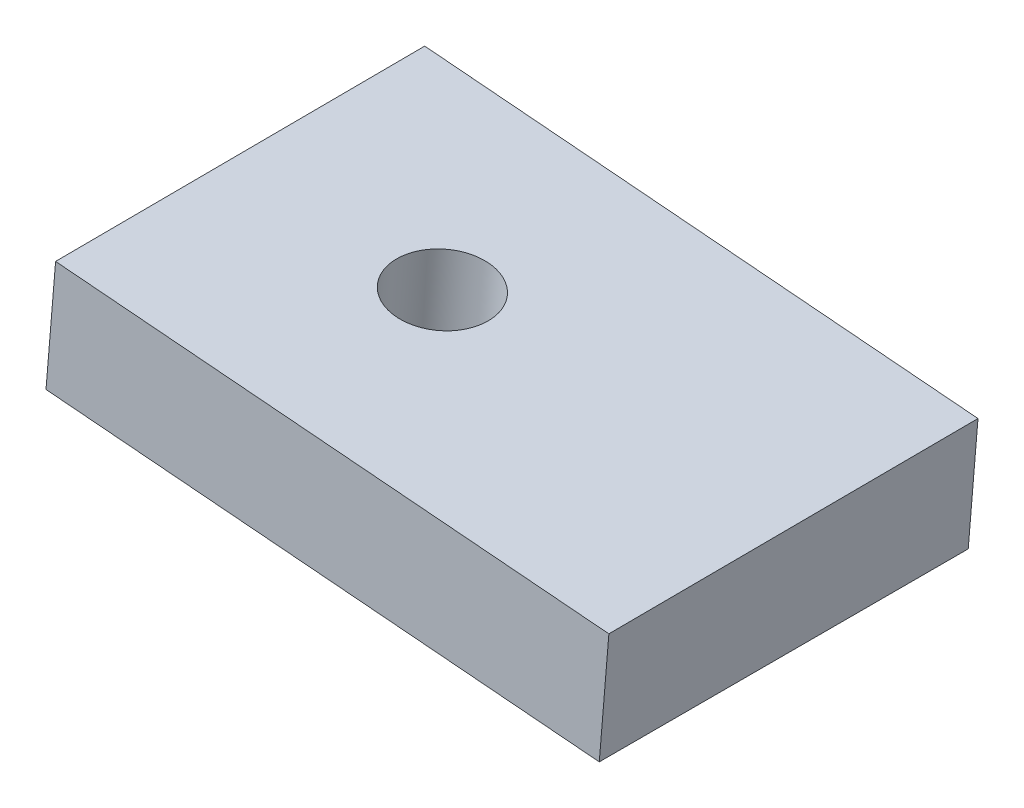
ISO-10303-21;
HEADER;
FILE_DESCRIPTION(('STEP AP214'),'2;1');
FILE_NAME('part.step','',(''),(''),'','','');
FILE_SCHEMA(('AUTOMOTIVE_DESIGN { 1 0 10303 214 1 1 1 1 }'));
ENDSEC;
DATA;
#1=APPLICATION_CONTEXT('core data for automotive mechanical design processes');
#2=APPLICATION_PROTOCOL_DEFINITION('international standard','automotive_design',2000,#1);
#3=PRODUCT_CONTEXT('',#1,'mechanical');
#4=PRODUCT('Part','Part','',(#3));
#5=PRODUCT_RELATED_PRODUCT_CATEGORY('part','',(#4));
#6=PRODUCT_DEFINITION_FORMATION('','',#4);
#7=PRODUCT_DEFINITION_CONTEXT('part definition',#1,'design');
#8=PRODUCT_DEFINITION('design','',#6,#7);
#9=PRODUCT_DEFINITION_SHAPE('','',#8);
#10=(LENGTH_UNIT() NAMED_UNIT(*) SI_UNIT(.MILLI.,.METRE.));
#11=(NAMED_UNIT(*) PLANE_ANGLE_UNIT() SI_UNIT($,.RADIAN.));
#12=(NAMED_UNIT(*) SI_UNIT($,.STERADIAN.) SOLID_ANGLE_UNIT());
#13=UNCERTAINTY_MEASURE_WITH_UNIT(LENGTH_MEASURE(1.E-05),#10,'distance_accuracy_value','');
#14=(GEOMETRIC_REPRESENTATION_CONTEXT(3) GLOBAL_UNCERTAINTY_ASSIGNED_CONTEXT((#13)) GLOBAL_UNIT_ASSIGNED_CONTEXT((#10,
#11,#12)) REPRESENTATION_CONTEXT('',''));
#15=CARTESIAN_POINT('',(0.,0.,0.));
#16=DIRECTION('',(0.,0.,1.));
#17=DIRECTION('',(1.,0.,0.));
#18=AXIS2_PLACEMENT_3D('',#15,#16,#17);
#19=CARTESIAN_POINT('',(-25.1929971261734,-10.6671746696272,0.));
#20=DIRECTION('',(0.,0.,-1.));
#21=DIRECTION('',(-1.,0.,0.));
#22=AXIS2_PLACEMENT_3D('',#19,#20,#21);
#23=PLANE('',#22);
#24=DIRECTION('',(0.996579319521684,-0.0826417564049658,0.));
#25=VECTOR('',#24,1.);
#26=CARTESIAN_POINT('',(-25.4577662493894,-13.8600331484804,0.));
#27=LINE('',#26,#25);
#28=CARTESIAN_POINT('',(-25.4577662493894,-13.8600331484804,0.));
#29=VERTEX_POINT('',#28);
#30=CARTESIAN_POINT('',(-10.4616682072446,-15.1035908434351,0.));
#31=VERTEX_POINT('',#30);
#32=EDGE_CURVE('E99',#29,#31,#27,.T.);
#33=ORIENTED_EDGE('',*,*,#32,.F.);
#34=DIRECTION('',(-0.0826417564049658,-0.996579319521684,0.));
#35=VECTOR('',#34,1.);
#36=CARTESIAN_POINT('',(-25.1929971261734,-10.6671746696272,0.));
#37=LINE('',#36,#35);
#38=CARTESIAN_POINT('',(-25.1929971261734,-10.6671746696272,0.));
#39=VERTEX_POINT('',#38);
#40=EDGE_CURVE('E11',#39,#29,#37,.T.);
#41=ORIENTED_EDGE('',*,*,#40,.F.);
#42=DIRECTION('',(0.996579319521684,-0.0826417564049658,0.));
#43=VECTOR('',#42,1.);
#44=CARTESIAN_POINT('',(-25.1929971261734,-10.6671746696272,0.));
#45=LINE('',#44,#43);
#46=CARTESIAN_POINT('',(-10.1968990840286,-11.9107323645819,0.));
#47=VERTEX_POINT('',#46);
#48=EDGE_CURVE('E87',#39,#47,#45,.T.);
#49=ORIENTED_EDGE('',*,*,#48,.T.);
#50=DIRECTION('',(-0.0826417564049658,-0.996579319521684,0.));
#51=VECTOR('',#50,1.);
#52=CARTESIAN_POINT('',(-10.1968990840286,-11.9107323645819,0.));
#53=LINE('',#52,#51);
#54=EDGE_CURVE('E76',#47,#31,#53,.T.);
#55=ORIENTED_EDGE('',*,*,#54,.T.);
#56=EDGE_LOOP('',(#33,#41,#49,#55));
#57=FACE_BOUND('',#56,.T.);
#58=ADVANCED_FACE('F33',(#57),#23,.T.);
#59=CARTESIAN_POINT('',(-25.1929971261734,-10.6671746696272,9.99999999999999));
#60=DIRECTION('',(-0.996579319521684,0.0826417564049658,0.));
#61=DIRECTION('',(-0.0826417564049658,-0.996579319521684,0.));
#62=AXIS2_PLACEMENT_3D('',#59,#60,#61);
#63=PLANE('',#62);
#64=DIRECTION('',(0.,0.,-1.));
#65=VECTOR('',#64,1.);
#66=CARTESIAN_POINT('',(-25.4577662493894,-13.8600331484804,9.99999999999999));
#67=LINE('',#66,#65);
#68=CARTESIAN_POINT('',(-25.4577662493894,-13.8600331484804,9.99999999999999));
#69=VERTEX_POINT('',#68);
#70=EDGE_CURVE('E91',#69,#29,#67,.T.);
#71=ORIENTED_EDGE('',*,*,#70,.F.);
#72=DIRECTION('',(-0.0826417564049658,-0.996579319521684,0.));
#73=VECTOR('',#72,1.);
#74=CARTESIAN_POINT('',(-25.1929971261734,-10.6671746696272,9.99999999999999));
#75=LINE('',#74,#73);
#76=CARTESIAN_POINT('',(-25.1976958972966,-10.7238372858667,9.99999999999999));
#77=VERTEX_POINT('',#76);
#78=EDGE_CURVE('E43',#77,#69,#75,.T.);
#79=ORIENTED_EDGE('',*,*,#78,.F.);
#80=DIRECTION('',(-0.000469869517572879,-0.00566617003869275,0.999983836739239));
#81=VECTOR('',#80,1.);
#82=CARTESIAN_POINT('',(-25.1929971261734,-10.6671746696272,0.));
#83=LINE('',#82,#81);
#84=EDGE_CURVE('E83',#77,#39,#83,.F.);
#85=ORIENTED_EDGE('',*,*,#84,.T.);
#86=ORIENTED_EDGE('',*,*,#40,.T.);
#87=EDGE_LOOP('',(#71,#79,#85,#86));
#88=FACE_BOUND('',#87,.T.);
#89=ADVANCED_FACE('F108',(#88),#63,.T.);
#90=CARTESIAN_POINT('',(-10.1968990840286,-11.9107323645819,10.));
#91=DIRECTION('',(0.,0.,1.));
#92=DIRECTION('',(1.,0.,0.));
#93=AXIS2_PLACEMENT_3D('',#90,#91,#92);
#94=PLANE('',#93);
#95=DIRECTION('',(-0.996579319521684,0.0826417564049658,0.));
#96=VECTOR('',#95,1.);
#97=CARTESIAN_POINT('',(-10.4616682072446,-15.1035908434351,10.));
#98=LINE('',#97,#96);
#99=CARTESIAN_POINT('',(-10.4616682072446,-15.1035908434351,10.));
#100=VERTEX_POINT('',#99);
#101=EDGE_CURVE('E94',#100,#69,#98,.T.);
#102=ORIENTED_EDGE('',*,*,#101,.F.);
#103=DIRECTION('',(-0.0826417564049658,-0.996579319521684,0.));
#104=VECTOR('',#103,1.);
#105=CARTESIAN_POINT('',(-10.1968990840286,-11.9107323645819,10.));
#106=LINE('',#105,#104);
#107=CARTESIAN_POINT('',(-10.2015978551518,-11.9673949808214,10.));
#108=VERTEX_POINT('',#107);
#109=EDGE_CURVE('E70',#108,#100,#106,.T.);
#110=ORIENTED_EDGE('',*,*,#109,.F.);
#111=DIRECTION('',(0.996579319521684,-0.0826417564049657,0.));
#112=VECTOR('',#111,1.);
#113=CARTESIAN_POINT('',(-25.1976958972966,-10.7238372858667,9.99999999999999));
#114=LINE('',#113,#112);
#115=EDGE_CURVE('E89',#108,#77,#114,.F.);
#116=ORIENTED_EDGE('',*,*,#115,.T.);
#117=ORIENTED_EDGE('',*,*,#78,.T.);
#118=EDGE_LOOP('',(#102,#110,#116,#117));
#119=FACE_BOUND('',#118,.T.);
#120=ADVANCED_FACE('F109',(#119),#94,.T.);
#121=CARTESIAN_POINT('',(-10.1968990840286,-11.9107323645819,0.));
#122=DIRECTION('',(0.996579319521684,-0.0826417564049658,0.));
#123=DIRECTION('',(0.0826417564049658,0.996579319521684,0.));
#124=AXIS2_PLACEMENT_3D('',#121,#122,#123);
#125=PLANE('',#124);
#126=DIRECTION('',(0.,0.,1.));
#127=VECTOR('',#126,1.);
#128=CARTESIAN_POINT('',(-10.4616682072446,-15.1035908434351,0.));
#129=LINE('',#128,#127);
#130=EDGE_CURVE('E81',#31,#100,#129,.T.);
#131=ORIENTED_EDGE('',*,*,#130,.F.);
#132=ORIENTED_EDGE('',*,*,#54,.F.);
#133=DIRECTION('',(0.000469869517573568,0.00566617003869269,-0.999983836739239));
#134=VECTOR('',#133,1.);
#135=CARTESIAN_POINT('',(-10.1968990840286,-11.9107323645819,0.));
#136=LINE('',#135,#134);
#137=EDGE_CURVE('E79',#47,#108,#136,.F.);
#138=ORIENTED_EDGE('',*,*,#137,.T.);
#139=ORIENTED_EDGE('',*,*,#109,.T.);
#140=EDGE_LOOP('',(#131,#132,#138,#139));
#141=FACE_BOUND('',#140,.T.);
#142=ADVANCED_FACE('F78',(#141),#125,.T.);
#143=CARTESIAN_POINT('',(-25.1929971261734,-10.6671746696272,0.));
#144=DIRECTION('',(0.0826404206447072,0.996563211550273,0.00568561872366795));
#145=DIRECTION('',(-0.996579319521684,0.0826417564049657,0.));
#146=AXIS2_PLACEMENT_3D('',#143,#144,#145);
#147=PLANE('',#146);
#148=CARTESIAN_POINT('',(-19.7141602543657,-11.1500356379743,5.));
#149=DIRECTION('',(0.0826404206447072,0.996563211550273,0.00568561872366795));
#150=DIRECTION('',(0.000469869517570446,0.00566617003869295,-0.999983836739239));
#151=AXIS2_PLACEMENT_3D('',#148,#149,#150);
#152=ELLIPSE('',#151,1.25002020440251,1.24999999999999);
#153=CARTESIAN_POINT('',(-19.7135729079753,-11.1429528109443,3.75000000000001));
#154=VERTEX_POINT('',#153);
#155=EDGE_CURVE('E98',#154,#154,#152,.F.);
#156=ORIENTED_EDGE('',*,*,#155,.T.);
#157=EDGE_LOOP('',(#156));
#158=FACE_BOUND('',#157,.T.);
#159=ORIENTED_EDGE('',*,*,#48,.F.);
#160=ORIENTED_EDGE('',*,*,#84,.F.);
#161=ORIENTED_EDGE('',*,*,#115,.F.);
#162=ORIENTED_EDGE('',*,*,#137,.F.);
#163=EDGE_LOOP('',(#159,#160,#161,#162));
#164=FACE_BOUND('',#163,.T.);
#165=ADVANCED_FACE('F35',(#158,#164),#147,.T.);
#166=CARTESIAN_POINT('',(-1.31536726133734,-15.8620516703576,0.));
#167=DIRECTION('',(-0.0826417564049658,-0.996579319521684,0.));
#168=DIRECTION('',(0.996579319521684,-0.0826417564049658,0.));
#169=AXIS2_PLACEMENT_3D('',#166,#167,#168);
#170=PLANE('',#169);
#171=CARTESIAN_POINT('',(-19.9765799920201,-14.3145628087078,5.));
#172=DIRECTION('',(-0.0826417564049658,-0.996579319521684,0.));
#173=DIRECTION('',(0.996579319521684,-0.0826417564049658,0.));
#174=AXIS2_PLACEMENT_3D('',#171,#172,#173);
#175=CIRCLE('',#174,1.24999999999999);
#176=CARTESIAN_POINT('',(-18.730855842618,-14.417865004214,5.));
#177=VERTEX_POINT('',#176);
#178=EDGE_CURVE('E37',#177,#177,#175,.T.);
#179=ORIENTED_EDGE('',*,*,#178,.F.);
#180=EDGE_LOOP('',(#179));
#181=FACE_BOUND('',#180,.T.);
#182=ORIENTED_EDGE('',*,*,#32,.T.);
#183=ORIENTED_EDGE('',*,*,#130,.T.);
#184=ORIENTED_EDGE('',*,*,#101,.T.);
#185=ORIENTED_EDGE('',*,*,#70,.T.);
#186=EDGE_LOOP('',(#182,#183,#184,#185));
#187=FACE_BOUND('',#186,.T.);
#188=ADVANCED_FACE('F144',(#181,#187),#170,.T.);
#189=CARTESIAN_POINT('',(-19.7135729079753,-11.1429528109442,5.));
#190=DIRECTION('',(0.0826417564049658,0.996579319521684,0.));
#191=DIRECTION('',(-0.996579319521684,0.0826417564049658,0.));
#192=AXIS2_PLACEMENT_3D('',#189,#190,#191);
#193=CYLINDRICAL_SURFACE('',#192,1.24999999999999);
#194=ORIENTED_EDGE('',*,*,#178,.T.);
#195=EDGE_LOOP('',(#194));
#196=FACE_BOUND('',#195,.T.);
#197=ORIENTED_EDGE('',*,*,#155,.F.);
#198=EDGE_LOOP('',(#197));
#199=FACE_BOUND('',#198,.T.);
#200=ADVANCED_FACE('F153',(#196,#199),#193,.F.);
#201=CLOSED_SHELL('',(#58,#89,#120,#142,#165,#188,#200));
#202=MANIFOLD_SOLID_BREP('B2',#201);
#203=ADVANCED_BREP_SHAPE_REPRESENTATION('',(#18,#202),#14);
#204=SHAPE_DEFINITION_REPRESENTATION(#9,#203);
ENDSEC;
END-ISO-10303-21;
